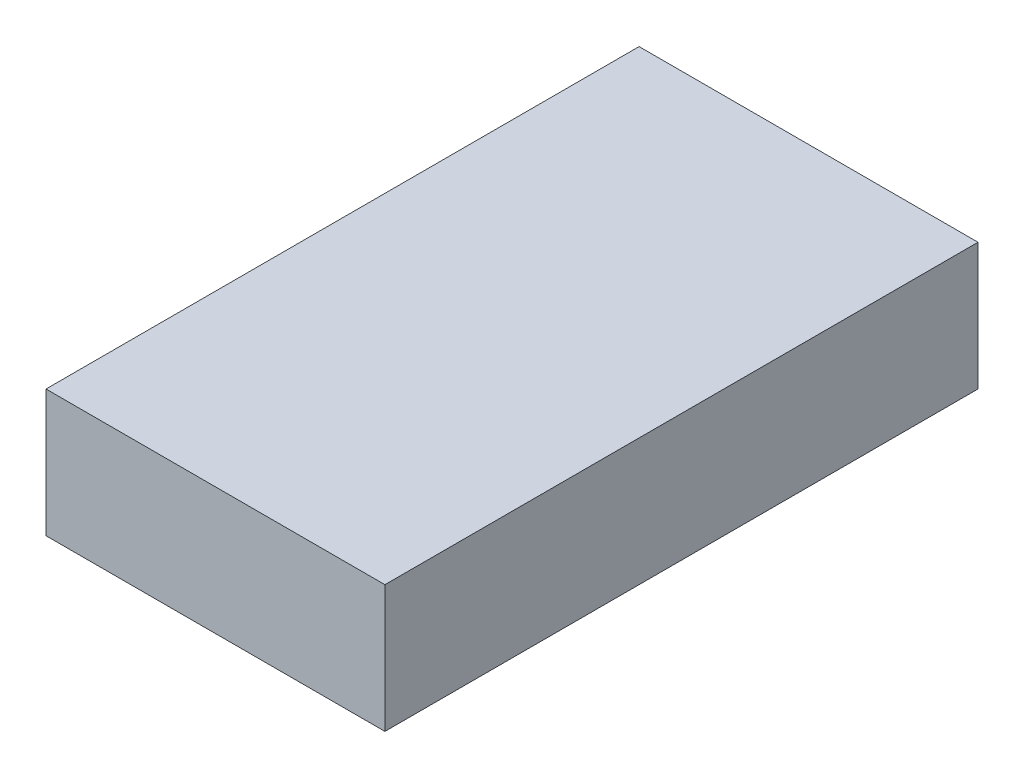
ISO-10303-21;
HEADER;
FILE_DESCRIPTION(('STEP AP214'),'2;1');
FILE_NAME('part.step','',(''),(''),'','','');
FILE_SCHEMA(('AUTOMOTIVE_DESIGN { 1 0 10303 214 1 1 1 1 }'));
ENDSEC;
DATA;
#1=APPLICATION_CONTEXT('core data for automotive mechanical design processes');
#2=APPLICATION_PROTOCOL_DEFINITION('international standard','automotive_design',2000,#1);
#3=PRODUCT_CONTEXT('',#1,'mechanical');
#4=PRODUCT('Part','Part','',(#3));
#5=PRODUCT_RELATED_PRODUCT_CATEGORY('part','',(#4));
#6=PRODUCT_DEFINITION_FORMATION('','',#4);
#7=PRODUCT_DEFINITION_CONTEXT('part definition',#1,'design');
#8=PRODUCT_DEFINITION('design','',#6,#7);
#9=PRODUCT_DEFINITION_SHAPE('','',#8);
#10=(LENGTH_UNIT() NAMED_UNIT(*) SI_UNIT(.MILLI.,.METRE.));
#11=(NAMED_UNIT(*) PLANE_ANGLE_UNIT() SI_UNIT($,.RADIAN.));
#12=(NAMED_UNIT(*) SI_UNIT($,.STERADIAN.) SOLID_ANGLE_UNIT());
#13=UNCERTAINTY_MEASURE_WITH_UNIT(LENGTH_MEASURE(1.E-05),#10,'distance_accuracy_value','');
#14=(GEOMETRIC_REPRESENTATION_CONTEXT(3) GLOBAL_UNCERTAINTY_ASSIGNED_CONTEXT((#13)) GLOBAL_UNIT_ASSIGNED_CONTEXT((#10,
#11,#12)) REPRESENTATION_CONTEXT('',''));
#15=CARTESIAN_POINT('',(0.,0.,0.));
#16=DIRECTION('',(0.,0.,1.));
#17=DIRECTION('',(1.,0.,0.));
#18=AXIS2_PLACEMENT_3D('',#15,#16,#17);
#19=CARTESIAN_POINT('',(-25.4,0.,-88.9));
#20=DIRECTION('',(0.,0.,1.));
#21=DIRECTION('',(1.,0.,0.));
#22=AXIS2_PLACEMENT_3D('',#19,#20,#21);
#23=PLANE('',#22);
#24=DIRECTION('',(0.,-1.,0.));
#25=VECTOR('',#24,1.);
#26=CARTESIAN_POINT('',(-25.4,19.05,-88.9));
#27=LINE('',#26,#25);
#28=CARTESIAN_POINT('',(-25.4,19.05,-88.9));
#29=VERTEX_POINT('',#28);
#30=CARTESIAN_POINT('',(-25.4,0.,-88.9));
#31=VERTEX_POINT('',#30);
#32=EDGE_CURVE('E98',#29,#31,#27,.T.);
#33=ORIENTED_EDGE('',*,*,#32,.F.);
#34=DIRECTION('',(-1.,0.,0.));
#35=VECTOR('',#34,1.);
#36=CARTESIAN_POINT('',(-25.4,19.05,-88.9));
#37=LINE('',#36,#35);
#38=CARTESIAN_POINT('',(25.4,19.05,-88.9));
#39=VERTEX_POINT('',#38);
#40=EDGE_CURVE('E103',#39,#29,#37,.T.);
#41=ORIENTED_EDGE('',*,*,#40,.F.);
#42=DIRECTION('',(0.,1.,0.));
#43=VECTOR('',#42,1.);
#44=CARTESIAN_POINT('',(25.4,19.05,-88.9));
#45=LINE('',#44,#43);
#46=CARTESIAN_POINT('',(25.4,0.,-88.9));
#47=VERTEX_POINT('',#46);
#48=EDGE_CURVE('E107',#47,#39,#45,.T.);
#49=ORIENTED_EDGE('',*,*,#48,.F.);
#50=DIRECTION('',(1.,0.,0.));
#51=VECTOR('',#50,1.);
#52=CARTESIAN_POINT('',(-25.4,0.,-88.9));
#53=LINE('',#52,#51);
#54=EDGE_CURVE('E110',#31,#47,#53,.T.);
#55=ORIENTED_EDGE('',*,*,#54,.F.);
#56=EDGE_LOOP('',(#33,#41,#49,#55));
#57=FACE_BOUND('',#56,.T.);
#58=ADVANCED_FACE('F52',(#57),#23,.F.);
#59=CARTESIAN_POINT('',(-25.4,0.,0.));
#60=DIRECTION('',(0.,0.,1.));
#61=DIRECTION('',(1.,0.,0.));
#62=AXIS2_PLACEMENT_3D('',#59,#60,#61);
#63=PLANE('',#62);
#64=DIRECTION('',(0.,-1.,0.));
#65=VECTOR('',#64,1.);
#66=CARTESIAN_POINT('',(-25.4,19.05,0.));
#67=LINE('',#66,#65);
#68=CARTESIAN_POINT('',(-25.4,19.05,0.));
#69=VERTEX_POINT('',#68);
#70=CARTESIAN_POINT('',(-25.4,0.,0.));
#71=VERTEX_POINT('',#70);
#72=EDGE_CURVE('E100',#69,#71,#67,.T.);
#73=ORIENTED_EDGE('',*,*,#72,.T.);
#74=DIRECTION('',(1.,0.,0.));
#75=VECTOR('',#74,1.);
#76=CARTESIAN_POINT('',(-25.4,0.,0.));
#77=LINE('',#76,#75);
#78=CARTESIAN_POINT('',(25.4,0.,0.));
#79=VERTEX_POINT('',#78);
#80=EDGE_CURVE('E120',#71,#79,#77,.T.);
#81=ORIENTED_EDGE('',*,*,#80,.T.);
#82=DIRECTION('',(0.,1.,0.));
#83=VECTOR('',#82,1.);
#84=CARTESIAN_POINT('',(25.4,19.05,0.));
#85=LINE('',#84,#83);
#86=CARTESIAN_POINT('',(25.4,19.05,0.));
#87=VERTEX_POINT('',#86);
#88=EDGE_CURVE('E56',#79,#87,#85,.T.);
#89=ORIENTED_EDGE('',*,*,#88,.T.);
#90=DIRECTION('',(-1.,0.,0.));
#91=VECTOR('',#90,1.);
#92=CARTESIAN_POINT('',(-25.4,19.05,0.));
#93=LINE('',#92,#91);
#94=EDGE_CURVE('E12',#87,#69,#93,.T.);
#95=ORIENTED_EDGE('',*,*,#94,.T.);
#96=EDGE_LOOP('',(#73,#81,#89,#95));
#97=FACE_BOUND('',#96,.T.);
#98=ADVANCED_FACE('F54',(#97),#63,.T.);
#99=CARTESIAN_POINT('',(25.4,19.05,0.));
#100=DIRECTION('',(1.,0.,0.));
#101=DIRECTION('',(0.,-1.,0.));
#102=AXIS2_PLACEMENT_3D('',#99,#100,#101);
#103=PLANE('',#102);
#104=ORIENTED_EDGE('',*,*,#88,.F.);
#105=DIRECTION('',(0.,0.,-1.));
#106=VECTOR('',#105,1.);
#107=CARTESIAN_POINT('',(25.4,0.,-44.4499999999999));
#108=LINE('',#107,#106);
#109=EDGE_CURVE('E116',#79,#47,#108,.T.);
#110=ORIENTED_EDGE('',*,*,#109,.T.);
#111=ORIENTED_EDGE('',*,*,#48,.T.);
#112=DIRECTION('',(0.,0.,1.));
#113=VECTOR('',#112,1.);
#114=CARTESIAN_POINT('',(25.4,19.05,-44.4499999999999));
#115=LINE('',#114,#113);
#116=EDGE_CURVE('E67',#39,#87,#115,.T.);
#117=ORIENTED_EDGE('',*,*,#116,.T.);
#118=EDGE_LOOP('',(#104,#110,#111,#117));
#119=FACE_BOUND('',#118,.T.);
#120=ADVANCED_FACE('F126',(#119),#103,.T.);
#121=CARTESIAN_POINT('',(25.4,0.,0.));
#122=DIRECTION('',(0.,-1.,0.));
#123=DIRECTION('',(-1.,0.,0.));
#124=AXIS2_PLACEMENT_3D('',#121,#122,#123);
#125=PLANE('',#124);
#126=ORIENTED_EDGE('',*,*,#80,.F.);
#127=DIRECTION('',(0.,0.,-1.));
#128=VECTOR('',#127,1.);
#129=CARTESIAN_POINT('',(-25.4,0.,-44.4499999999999));
#130=LINE('',#129,#128);
#131=EDGE_CURVE('E102',#71,#31,#130,.T.);
#132=ORIENTED_EDGE('',*,*,#131,.T.);
#133=ORIENTED_EDGE('',*,*,#54,.T.);
#134=ORIENTED_EDGE('',*,*,#109,.F.);
#135=EDGE_LOOP('',(#126,#132,#133,#134));
#136=FACE_BOUND('',#135,.T.);
#137=ADVANCED_FACE('F125',(#136),#125,.T.);
#138=CARTESIAN_POINT('',(-25.4,19.05,0.));
#139=DIRECTION('',(0.,1.,0.));
#140=DIRECTION('',(1.,0.,0.));
#141=AXIS2_PLACEMENT_3D('',#138,#139,#140);
#142=PLANE('',#141);
#143=ORIENTED_EDGE('',*,*,#94,.F.);
#144=ORIENTED_EDGE('',*,*,#116,.F.);
#145=ORIENTED_EDGE('',*,*,#40,.T.);
#146=DIRECTION('',(0.,0.,-1.));
#147=VECTOR('',#146,1.);
#148=CARTESIAN_POINT('',(-25.4,19.05,-44.4499999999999));
#149=LINE('',#148,#147);
#150=EDGE_CURVE('E93',#69,#29,#149,.T.);
#151=ORIENTED_EDGE('',*,*,#150,.F.);
#152=EDGE_LOOP('',(#143,#144,#145,#151));
#153=FACE_BOUND('',#152,.T.);
#154=ADVANCED_FACE('F105',(#153),#142,.T.);
#155=CARTESIAN_POINT('',(-25.4,0.,0.));
#156=DIRECTION('',(-1.,0.,0.));
#157=DIRECTION('',(0.,1.,0.));
#158=AXIS2_PLACEMENT_3D('',#155,#156,#157);
#159=PLANE('',#158);
#160=ORIENTED_EDGE('',*,*,#72,.F.);
#161=ORIENTED_EDGE('',*,*,#150,.T.);
#162=ORIENTED_EDGE('',*,*,#32,.T.);
#163=ORIENTED_EDGE('',*,*,#131,.F.);
#164=EDGE_LOOP('',(#160,#161,#162,#163));
#165=FACE_BOUND('',#164,.T.);
#166=ADVANCED_FACE('F95',(#165),#159,.T.);
#167=CLOSED_SHELL('',(#58,#98,#120,#137,#154,#166));
#168=MANIFOLD_SOLID_BREP('B2',#167);
#169=ADVANCED_BREP_SHAPE_REPRESENTATION('',(#18,#168),#14);
#170=SHAPE_DEFINITION_REPRESENTATION(#9,#169);
ENDSEC;
END-ISO-10303-21;
